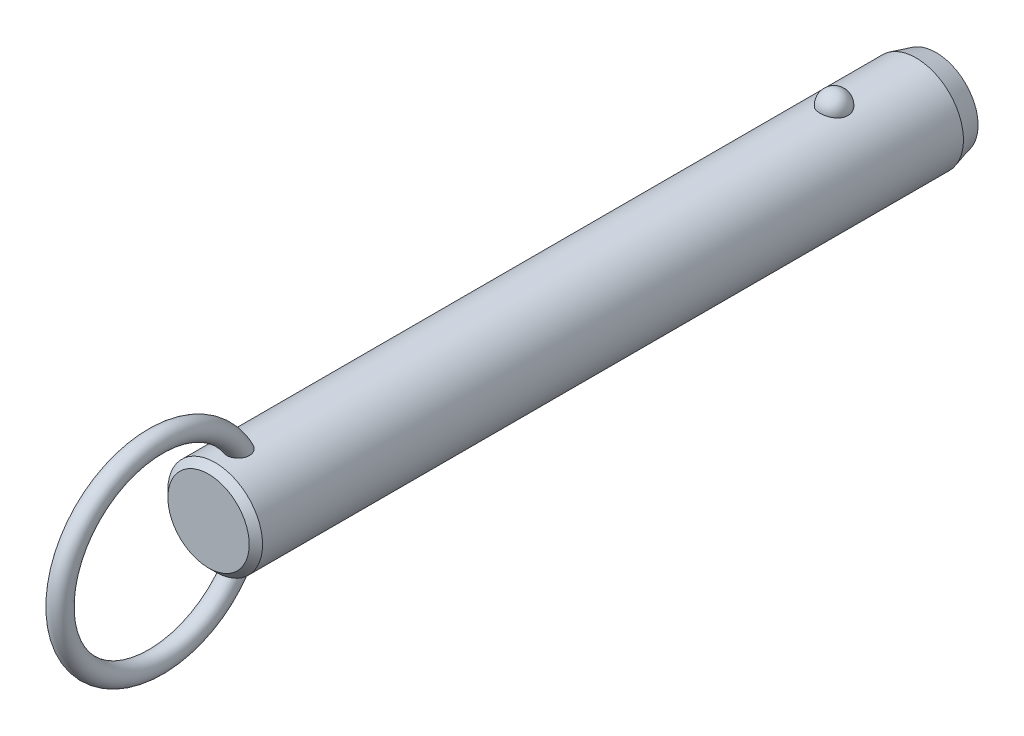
ISO-10303-21;
HEADER;
FILE_DESCRIPTION(('STEP AP214'),'2;1');
FILE_NAME('part.step','',(''),(''),'','','');
FILE_SCHEMA(('AUTOMOTIVE_DESIGN { 1 0 10303 214 1 1 1 1 }'));
ENDSEC;
DATA;
#1=APPLICATION_CONTEXT('core data for automotive mechanical design processes');
#2=APPLICATION_PROTOCOL_DEFINITION('international standard','automotive_design',2000,#1);
#3=PRODUCT_CONTEXT('',#1,'mechanical');
#4=PRODUCT('Part','Part','',(#3));
#5=PRODUCT_RELATED_PRODUCT_CATEGORY('part','',(#4));
#6=PRODUCT_DEFINITION_FORMATION('','',#4);
#7=PRODUCT_DEFINITION_CONTEXT('part definition',#1,'design');
#8=PRODUCT_DEFINITION('design','',#6,#7);
#9=PRODUCT_DEFINITION_SHAPE('','',#8);
#10=(LENGTH_UNIT() NAMED_UNIT(*) SI_UNIT(.MILLI.,.METRE.));
#11=(NAMED_UNIT(*) PLANE_ANGLE_UNIT() SI_UNIT($,.RADIAN.));
#12=(NAMED_UNIT(*) SI_UNIT($,.STERADIAN.) SOLID_ANGLE_UNIT());
#13=UNCERTAINTY_MEASURE_WITH_UNIT(LENGTH_MEASURE(1.E-05),#10,'distance_accuracy_value','');
#14=(GEOMETRIC_REPRESENTATION_CONTEXT(3) GLOBAL_UNCERTAINTY_ASSIGNED_CONTEXT((#13)) GLOBAL_UNIT_ASSIGNED_CONTEXT((#10,
#11,#12)) REPRESENTATION_CONTEXT('',''));
#15=CARTESIAN_POINT('',(0.,0.,0.));
#16=DIRECTION('',(0.,0.,1.));
#17=DIRECTION('',(1.,0.,0.));
#18=AXIS2_PLACEMENT_3D('',#15,#16,#17);
#19=CARTESIAN_POINT('',(0.,0.,83.8));
#20=DIRECTION('',(0.,0.,-1.));
#21=DIRECTION('',(-1.,0.,0.));
#22=AXIS2_PLACEMENT_3D('',#19,#20,#21);
#23=CYLINDRICAL_SURFACE('',#22,7.1);
#24=CARTESIAN_POINT('',(2.0769088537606,6.78943661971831,-2.1));
#25=CARTESIAN_POINT('',(2.07690739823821,6.78943796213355,-1.98268154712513));
#26=CARTESIAN_POINT('',(2.06738130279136,6.79237331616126,-1.86534506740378));
#27=CARTESIAN_POINT('',(2.0295040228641,6.8037853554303,-1.63400788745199));
#28=CARTESIAN_POINT('',(2.00114757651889,6.81226358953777,-1.52000812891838));
#29=CARTESIAN_POINT('',(1.92632025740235,6.83379798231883,-1.29863433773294));
#30=CARTESIAN_POINT('',(1.87985726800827,6.84685214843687,-1.19125744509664));
#31=CARTESIAN_POINT('',(1.76995205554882,6.87608091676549,-0.98604657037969));
#32=CARTESIAN_POINT('',(1.70650980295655,6.8922555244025,-0.88821260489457));
#33=CARTESIAN_POINT('',(1.5638119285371,6.92602930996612,-0.704242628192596));
#34=CARTESIAN_POINT('',(1.4844714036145,6.94363582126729,-0.618173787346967));
#35=CARTESIAN_POINT('',(1.31221746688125,6.97823658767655,-0.460740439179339));
#36=CARTESIAN_POINT('',(1.21930409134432,6.99523084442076,-0.389375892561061));
#37=CARTESIAN_POINT('',(1.02268781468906,7.02666176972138,-0.263547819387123));
#38=CARTESIAN_POINT('',(0.91902009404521,7.04110638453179,-0.209031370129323));
#39=CARTESIAN_POINT('',(0.703548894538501,7.06588726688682,-0.118163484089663));
#40=CARTESIAN_POINT('',(0.591746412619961,7.07622403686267,-0.0818098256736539));
#41=CARTESIAN_POINT('',(0.365557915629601,7.09147068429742,-0.0288711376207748));
#42=CARTESIAN_POINT('',(0.251267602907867,7.09648447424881,-0.0119070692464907));
#43=CARTESIAN_POINT('',(0.0213499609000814,7.10089837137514,0.00304925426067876));
#44=CARTESIAN_POINT('',(-0.0942772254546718,7.10029907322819,0.00104351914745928));
#45=CARTESIAN_POINT('',(-0.321651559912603,7.09360829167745,-0.0216931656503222));
#46=CARTESIAN_POINT('',(-0.433431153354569,7.08760388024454,-0.0421272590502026));
#47=CARTESIAN_POINT('',(-0.651862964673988,7.07086131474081,-0.100729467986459));
#48=CARTESIAN_POINT('',(-0.758515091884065,7.06012307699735,-0.138897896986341));
#49=CARTESIAN_POINT('',(-0.964449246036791,7.03496097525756,-0.232213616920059));
#50=CARTESIAN_POINT('',(-1.06368095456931,7.02051445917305,-0.287465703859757));
#51=CARTESIAN_POINT('',(-1.25145353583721,6.98948740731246,-0.413383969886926));
#52=CARTESIAN_POINT('',(-1.33999321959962,6.97290663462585,-0.48405186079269));
#53=CARTESIAN_POINT('',(-1.50591604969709,6.93898770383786,-0.640594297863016));
#54=CARTESIAN_POINT('',(-1.58302488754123,6.92164094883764,-0.726757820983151));
#55=CARTESIAN_POINT('',(-1.72189320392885,6.8884103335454,-0.91092752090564));
#56=CARTESIAN_POINT('',(-1.78365144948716,6.87252659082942,-1.008934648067));
#57=CARTESIAN_POINT('',(-1.89101272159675,6.84377189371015,-1.21549497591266));
#58=CARTESIAN_POINT('',(-1.93639553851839,6.83094274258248,-1.32416860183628));
#59=CARTESIAN_POINT('',(-2.00874275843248,6.81002070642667,-1.54791500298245));
#60=CARTESIAN_POINT('',(-2.03570774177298,6.80192767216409,-1.66298757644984));
#61=CARTESIAN_POINT('',(-2.07047276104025,6.7914266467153,-1.89571453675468));
#62=CARTESIAN_POINT('',(-2.07835878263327,6.78899315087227,-2.01335491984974));
#63=CARTESIAN_POINT('',(-2.07502083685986,6.79001409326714,-2.24833570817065));
#64=CARTESIAN_POINT('',(-2.06379746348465,6.7934683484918,-2.36567612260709));
#65=CARTESIAN_POINT('',(-2.02263913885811,6.80583442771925,-2.59603194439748));
#66=CARTESIAN_POINT('',(-1.99281127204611,6.81471501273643,-2.70906820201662));
#67=CARTESIAN_POINT('',(-1.91526639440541,6.83691232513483,-2.92836575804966));
#68=CARTESIAN_POINT('',(-1.8675486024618,6.85022924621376,-3.03462676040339));
#69=CARTESIAN_POINT('',(-1.75504492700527,6.87991336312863,-3.23806487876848));
#70=CARTESIAN_POINT('',(-1.69015924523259,6.89629822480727,-3.33518422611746));
#71=CARTESIAN_POINT('',(-1.54505404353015,6.93024852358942,-3.51697105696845));
#72=CARTESIAN_POINT('',(-1.46483385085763,6.94781401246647,-3.60163799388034));
#73=CARTESIAN_POINT('',(-1.29071406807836,6.98225977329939,-3.75654119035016));
#74=CARTESIAN_POINT('',(-1.19675650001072,6.99913673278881,-3.82671308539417));
#75=CARTESIAN_POINT('',(-0.997940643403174,7.03023618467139,-3.9501837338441));
#76=CARTESIAN_POINT('',(-0.89308318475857,7.04445887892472,-4.00348377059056));
#77=CARTESIAN_POINT('',(-0.676902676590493,7.06848365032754,-4.09107242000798));
#78=CARTESIAN_POINT('',(-0.565686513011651,7.0783430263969,-4.12560889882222));
#79=CARTESIAN_POINT('',(-0.338739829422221,7.09282534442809,-4.17575450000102));
#80=CARTESIAN_POINT('',(-0.223009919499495,7.09744899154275,-4.19136617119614));
#81=CARTESIAN_POINT('',(0.00707628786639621,7.10090930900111,-4.20307965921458));
#82=CARTESIAN_POINT('',(0.121410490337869,7.09986531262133,-4.19958377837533));
#83=CARTESIAN_POINT('',(0.347815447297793,7.092380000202,-4.17411564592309));
#84=CARTESIAN_POINT('',(0.459886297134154,7.08593891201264,-4.15214417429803));
#85=CARTESIAN_POINT('',(0.678084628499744,7.06838983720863,-4.09049562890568));
#86=CARTESIAN_POINT('',(0.784237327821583,7.05730369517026,-4.05090137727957));
#87=CARTESIAN_POINT('',(0.988305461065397,7.03163139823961,-3.95511447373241));
#88=CARTESIAN_POINT('',(1.08622031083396,7.01704499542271,-3.89892064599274));
#89=CARTESIAN_POINT('',(1.27284490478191,6.98562668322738,-3.77035541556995));
#90=CARTESIAN_POINT('',(1.36137372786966,6.96876135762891,-3.69772964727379));
#91=CARTESIAN_POINT('',(1.52509486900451,6.93477412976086,-3.53878279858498));
#92=CARTESIAN_POINT('',(1.60028496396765,6.91765218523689,-3.45245943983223));
#93=CARTESIAN_POINT('',(1.73681688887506,6.88465753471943,-3.26658774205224));
#94=CARTESIAN_POINT('',(1.79785966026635,6.86881574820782,-3.16681408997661));
#95=CARTESIAN_POINT('',(1.90265327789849,6.84053157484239,-2.95814408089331));
#96=CARTESIAN_POINT('',(1.94640861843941,6.82808830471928,-2.84925010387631));
#97=CARTESIAN_POINT('',(2.01274378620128,6.80881460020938,-2.63454318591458));
#98=CARTESIAN_POINT('',(2.03676193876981,6.80160856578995,-2.52920574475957));
#99=CARTESIAN_POINT('',(2.06884490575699,6.79191902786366,-2.3159172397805));
#100=CARTESIAN_POINT('',(2.07691019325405,6.78943538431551,-2.20796625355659));
#101=CARTESIAN_POINT('',(2.0769088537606,6.78943661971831,-2.1));
#102=B_SPLINE_CURVE_WITH_KNOTS('',3,(#24,#25,#26,#27,#28,#29,#30,#31,#32,#33,#34,#35,#36,#37,
#38,#39,#40,#41,#42,#43,#44,#45,#46,#47,#48,#49,#50,#51,#52,#53,#54,#55,#56,#57,#58,#59,#60,#61,
#62,#63,#64,#65,#66,#67,#68,#69,#70,#71,#72,#73,#74,#75,#76,#77,#78,#79,#80,#81,#82,#83,#84,#85,
#86,#87,#88,#89,#90,#91,#92,#93,#94,#95,#96,#97,#98,#99,#100,#101),.UNSPECIFIED.,.T.,.F.,(4,2,2,
2,2,2,2,2,2,2,2,2,2,2,2,2,2,2,2,2,2,2,2,2,2,2,2,2,2,2,2,2,2,2,2,2,2,2,4),(0.,0.351568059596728,
0.703234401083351,1.05474780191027,1.40626181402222,1.75970563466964,2.11314851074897,
2.4654696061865,2.81774759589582,3.16301449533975,3.50824481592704,3.84801136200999,
4.18778391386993,4.52968352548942,4.87162112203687,5.22076181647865,5.56993054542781,
5.92363364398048,6.27732559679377,6.62942052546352,6.98150450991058,7.33158042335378,
7.68167162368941,8.03384443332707,8.38603269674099,8.73975272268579,9.09344583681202,
9.44234545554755,9.79119807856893,10.1327344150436,10.4742563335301,10.8141898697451,
11.1541474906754,11.4997793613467,11.8454687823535,12.1979079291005,12.5502553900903,
12.8738073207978,13.1973496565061),.UNSPECIFIED.);
#103=CARTESIAN_POINT('',(2.0769088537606,6.78943661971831,-2.1));
#104=VERTEX_POINT('',#103);
#105=EDGE_CURVE('E41',#104,#104,#102,.T.);
#106=ORIENTED_EDGE('',*,*,#105,.T.);
#107=EDGE_LOOP('',(#106));
#108=FACE_BOUND('',#107,.T.);
#109=CARTESIAN_POINT('',(0.,0.,90.72));
#110=DIRECTION('',(0.,0.,1.));
#111=DIRECTION('',(1.,0.,0.));
#112=AXIS2_PLACEMENT_3D('',#109,#110,#111);
#113=CIRCLE('',#112,7.1);
#114=CARTESIAN_POINT('',(7.1,0.,90.72));
#115=VERTEX_POINT('',#114);
#116=EDGE_CURVE('E10',#115,#115,#113,.F.);
#117=ORIENTED_EDGE('',*,*,#116,.T.);
#118=EDGE_LOOP('',(#117));
#119=FACE_BOUND('',#118,.T.);
#120=CARTESIAN_POINT('',(-0.429539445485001,-7.08699541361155,85.5429212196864));
#121=CARTESIAN_POINT('',(-0.508331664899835,-7.08221999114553,85.5668764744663));
#122=CARTESIAN_POINT('',(-0.585039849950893,-7.07624016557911,85.5974570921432));
#123=CARTESIAN_POINT('',(-0.732082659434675,-7.06254296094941,85.6710242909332));
#124=CARTESIAN_POINT('',(-0.802417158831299,-7.05482554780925,85.7140111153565));
#125=CARTESIAN_POINT('',(-0.934722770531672,-7.03851844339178,85.8111135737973));
#126=CARTESIAN_POINT('',(-0.996700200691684,-7.02992941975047,85.8652207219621));
#127=CARTESIAN_POINT('',(-1.11079942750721,-7.01280697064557,85.9829676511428));
#128=CARTESIAN_POINT('',(-1.16292136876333,-7.00427354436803,86.0466072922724));
#129=CARTESIAN_POINT('',(-1.25705660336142,-6.98799959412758,86.1826870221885));
#130=CARTESIAN_POINT('',(-1.29888032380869,-6.98027525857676,86.2552598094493));
#131=CARTESIAN_POINT('',(-1.37069920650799,-6.96652886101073,86.4061686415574));
#132=CARTESIAN_POINT('',(-1.40069157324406,-6.96050720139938,86.4845060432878));
#133=CARTESIAN_POINT('',(-1.45043507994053,-6.95031881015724,86.6501903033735));
#134=CARTESIAN_POINT('',(-1.46937115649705,-6.94630231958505,86.7377897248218));
#135=CARTESIAN_POINT('',(-1.49424917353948,-6.94099239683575,86.9148714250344));
#136=CARTESIAN_POINT('',(-1.50018601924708,-6.93970003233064,87.0043544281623));
#137=CARTESIAN_POINT('',(-1.49978214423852,-6.93978815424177,87.1940607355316));
#138=CARTESIAN_POINT('',(-1.49187639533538,-6.94150934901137,87.294279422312));
#139=CARTESIAN_POINT('',(-1.46177925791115,-6.94790814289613,87.4924798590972));
#140=CARTESIAN_POINT('',(-1.43957541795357,-6.95258831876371,87.590459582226));
#141=CARTESIAN_POINT('',(-1.37783293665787,-6.96510647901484,87.7953629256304));
#142=CARTESIAN_POINT('',(-1.33634073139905,-6.97328848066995,87.9016801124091));
#143=CARTESIAN_POINT('',(-1.23686994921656,-6.99161706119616,88.1061777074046));
#144=CARTESIAN_POINT('',(-1.17889192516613,-7.00176357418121,88.2043583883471));
#145=CARTESIAN_POINT('',(-1.0587512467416,-7.02082898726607,88.372374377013));
#146=CARTESIAN_POINT('',(-0.999247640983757,-7.02963746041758,88.4441230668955));
#147=CARTESIAN_POINT('',(-0.869494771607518,-7.04686074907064,88.5771959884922));
#148=CARTESIAN_POINT('',(-0.79926347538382,-7.05527619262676,88.6385372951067));
#149=CARTESIAN_POINT('',(-0.665408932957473,-7.06899457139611,88.7351316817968));
#150=CARTESIAN_POINT('',(-0.603817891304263,-7.07457275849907,88.7731512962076));
#151=CARTESIAN_POINT('',(-0.475172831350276,-7.08437420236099,88.8387581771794));
#152=CARTESIAN_POINT('',(-0.408123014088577,-7.08859848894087,88.8663533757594));
#153=CARTESIAN_POINT('',(-0.269431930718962,-7.09522749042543,88.9092569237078));
#154=CARTESIAN_POINT('',(-0.197757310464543,-7.09761688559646,88.9244618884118));
#155=CARTESIAN_POINT('',(-0.0527849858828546,-7.10017268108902,88.9407168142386));
#156=CARTESIAN_POINT('',(0.0205115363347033,-7.10034065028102,88.9417767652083));
#157=CARTESIAN_POINT('',(0.156426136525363,-7.09855986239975,88.9304619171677));
#158=CARTESIAN_POINT('',(0.219199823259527,-7.09688191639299,88.9198060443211));
#159=CARTESIAN_POINT('',(0.342134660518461,-7.09201880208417,88.8885379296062));
#160=CARTESIAN_POINT('',(0.402295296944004,-7.08883333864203,88.8679237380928));
#161=CARTESIAN_POINT('',(0.520687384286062,-7.08113868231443,88.8172125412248));
#162=CARTESIAN_POINT('',(0.57879126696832,-7.07658958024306,88.7868272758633));
#163=CARTESIAN_POINT('',(0.690173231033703,-7.06659708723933,88.7183678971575));
#164=CARTESIAN_POINT('',(0.743447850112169,-7.061153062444,88.6802883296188));
#165=CARTESIAN_POINT('',(0.870947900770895,-7.04680292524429,88.5765929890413));
#166=CARTESIAN_POINT('',(0.941828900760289,-7.0375580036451,88.5068972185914));
#167=CARTESIAN_POINT('',(1.07136606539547,-7.01900793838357,88.3569450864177));
#168=CARTESIAN_POINT('',(1.13000013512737,-7.00970271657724,88.2766700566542));
#169=CARTESIAN_POINT('',(1.23579584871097,-6.99183327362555,88.1068997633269));
#170=CARTESIAN_POINT('',(1.28274271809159,-6.98328455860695,88.0172696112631));
#171=CARTESIAN_POINT('',(1.36351442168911,-6.96796352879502,87.8321763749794));
#172=CARTESIAN_POINT('',(1.39733971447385,-6.96119115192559,87.7367134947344));
#173=CARTESIAN_POINT('',(1.45579181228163,-6.94922464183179,87.5253092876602));
#174=CARTESIAN_POINT('',(1.47790145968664,-6.94449000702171,87.408631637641));
#175=CARTESIAN_POINT('',(1.50168752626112,-6.93938731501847,87.1730153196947));
#176=CARTESIAN_POINT('',(1.50336085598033,-6.93901991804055,87.0540763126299));
#177=CARTESIAN_POINT('',(1.48486516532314,-6.9430010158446,86.8236079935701));
#178=CARTESIAN_POINT('',(1.46573441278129,-6.9471253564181,86.7119958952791));
#179=CARTESIAN_POINT('',(1.40606892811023,-6.95944667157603,86.4948868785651));
#180=CARTESIAN_POINT('',(1.3655644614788,-6.96763788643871,86.3893815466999));
#181=CARTESIAN_POINT('',(1.27082700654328,-6.98548038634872,86.2042879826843));
#182=CARTESIAN_POINT('',(1.21949810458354,-6.99473841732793,86.1231719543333));
#183=CARTESIAN_POINT('',(1.10242050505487,-7.01414069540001,85.9722278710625));
#184=CARTESIAN_POINT('',(1.03668119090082,-7.02428436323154,85.9023925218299));
#185=CARTESIAN_POINT('',(0.900559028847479,-7.04295285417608,85.7835735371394));
#186=CARTESIAN_POINT('',(0.831428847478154,-7.05153466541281,85.7331573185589));
#187=CARTESIAN_POINT('',(0.685291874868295,-7.06723150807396,85.6451429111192));
#188=CARTESIAN_POINT('',(0.608287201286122,-7.0743469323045,85.6075412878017));
#189=CARTESIAN_POINT('',(0.451878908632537,-7.08602232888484,85.5474915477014));
#190=CARTESIAN_POINT('',(0.372686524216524,-7.09067127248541,85.5245088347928));
#191=CARTESIAN_POINT('',(0.211477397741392,-7.09730788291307,85.4920357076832));
#192=CARTESIAN_POINT('',(0.129460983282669,-7.09929585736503,85.4825437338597));
#193=CARTESIAN_POINT('',(-0.0332905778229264,-7.10037858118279,85.4773517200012));
#194=CARTESIAN_POINT('',(-0.114016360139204,-7.09953334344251,85.4813656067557));
#195=CARTESIAN_POINT('',(-0.273670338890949,-7.09517338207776,85.5024540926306));
#196=CARTESIAN_POINT('',(-0.352598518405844,-7.09165863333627,85.5195288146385));
#197=CARTESIAN_POINT('',(-0.429539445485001,-7.08699541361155,85.5429212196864));
#198=B_SPLINE_CURVE_WITH_KNOTS('',3,(#120,#121,#122,#123,#124,#125,#126,#127,#128,#129,#130,
#131,#132,#133,#134,#135,#136,#137,#138,#139,#140,#141,#142,#143,#144,#145,#146,#147,#148,#149,
#150,#151,#152,#153,#154,#155,#156,#157,#158,#159,#160,#161,#162,#163,#164,#165,#166,#167,#168,
#169,#170,#171,#172,#173,#174,#175,#176,#177,#178,#179,#180,#181,#182,#183,#184,#185,#186,#187,
#188,#189,#190,#191,#192,#193,#194,#195,#196,#197),.UNSPECIFIED.,.T.,.F.,(4,2,2,2,2,2,2,2,2,2,2,
2,2,2,2,2,2,2,2,2,2,2,2,2,2,2,2,2,2,2,2,2,2,2,2,2,2,2,4),(0.,0.247183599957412,0.49437204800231,
0.741372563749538,0.988369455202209,1.23962059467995,1.49093106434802,1.75897818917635,
2.02713035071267,2.32758265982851,2.62829697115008,2.97008736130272,3.31186629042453,
3.59175319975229,3.87117637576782,4.08813841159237,4.30493502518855,4.52352259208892,
4.74195577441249,4.93215328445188,5.12238804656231,5.31884850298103,5.51544871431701,
5.81332317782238,6.11173048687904,6.41527266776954,6.71880423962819,7.07358156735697,
7.42841252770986,7.76631485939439,8.10373999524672,8.39142246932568,8.67891817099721,
8.93560332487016,9.19221962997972,9.43881106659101,9.68537399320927,9.92674752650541,
10.1681233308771),.UNSPECIFIED.);
#199=CARTESIAN_POINT('',(-0.429539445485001,-7.08699541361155,85.5429212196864));
#200=VERTEX_POINT('',#199);
#201=EDGE_CURVE('E59',#200,#200,#198,.T.);
#202=ORIENTED_EDGE('',*,*,#201,.T.);
#203=EDGE_LOOP('',(#202));
#204=FACE_BOUND('',#203,.T.);
#205=CARTESIAN_POINT('',(-0.429539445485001,7.08699541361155,85.5429212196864));
#206=CARTESIAN_POINT('',(-0.351665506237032,7.09171429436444,85.5192469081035));
#207=CARTESIAN_POINT('',(-0.271733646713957,7.09525896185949,85.5020369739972));
#208=CARTESIAN_POINT('',(-0.110026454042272,7.09960839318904,85.4810059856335));
#209=CARTESIAN_POINT('',(-0.0282502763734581,7.10041187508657,85.477191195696));
#210=CARTESIAN_POINT('',(0.134782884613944,7.09918849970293,85.483059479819));
#211=CARTESIAN_POINT('',(0.216039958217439,7.09716214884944,85.4927401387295));
#212=CARTESIAN_POINT('',(0.375730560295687,7.09050177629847,85.5253471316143));
#213=CARTESIAN_POINT('',(0.454164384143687,7.08586802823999,85.5482720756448));
#214=CARTESIAN_POINT('',(0.60602533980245,7.07449911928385,85.606771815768));
#215=CARTESIAN_POINT('',(0.679451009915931,7.06776334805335,85.6423502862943));
#216=CARTESIAN_POINT('',(0.819234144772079,7.05292866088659,85.7251753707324));
#217=CARTESIAN_POINT('',(0.88559181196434,7.04482978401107,85.7724216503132));
#218=CARTESIAN_POINT('',(1.00993211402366,7.02808709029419,85.8775902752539));
#219=CARTESIAN_POINT('',(1.06785399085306,7.01943990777,85.935583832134));
#220=CARTESIAN_POINT('',(1.17342527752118,7.00256662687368,86.0603013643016));
#221=CARTESIAN_POINT('',(1.22107408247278,6.99434055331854,86.1270258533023));
#222=CARTESIAN_POINT('',(1.30652927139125,6.97889183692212,86.2693622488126));
#223=CARTESIAN_POINT('',(1.34399711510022,6.97170674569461,86.3451808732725));
#224=CARTESIAN_POINT('',(1.40682616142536,6.95930080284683,86.5018100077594));
#225=CARTESIAN_POINT('',(1.43218374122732,6.95408053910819,86.5826220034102));
#226=CARTESIAN_POINT('',(1.47246409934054,6.94566853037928,86.7535314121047));
#227=CARTESIAN_POINT('',(1.48642590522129,6.9426653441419,86.8438630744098));
#228=CARTESIAN_POINT('',(1.5011410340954,6.93949744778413,87.025619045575));
#229=CARTESIAN_POINT('',(1.50188917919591,6.93933385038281,87.1170437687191));
#230=CARTESIAN_POINT('',(1.49030464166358,6.94183245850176,87.3108438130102));
#231=CARTESIAN_POINT('',(1.47627413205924,6.94486147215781,87.413112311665));
#232=CARTESIAN_POINT('',(1.43356351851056,6.95380194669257,87.6144719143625));
#233=CARTESIAN_POINT('',(1.4048676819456,6.95971650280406,87.7135594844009));
#234=CARTESIAN_POINT('',(1.32908750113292,6.97461208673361,87.9189087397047));
#235=CARTESIAN_POINT('',(1.28011435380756,6.98388945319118,88.0244566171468));
#236=CARTESIAN_POINT('',(1.16520357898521,7.00397743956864,88.2257604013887));
#237=CARTESIAN_POINT('',(1.09927694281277,7.01478706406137,88.3215225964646));
#238=CARTESIAN_POINT('',(0.969361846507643,7.03373936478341,88.4767565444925));
#239=CARTESIAN_POINT('',(0.909042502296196,7.04187023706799,88.5393032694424));
#240=CARTESIAN_POINT('',(0.779178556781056,7.05741732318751,88.6540535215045));
#241=CARTESIAN_POINT('',(0.709649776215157,7.06483472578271,88.7062744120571));
#242=CARTESIAN_POINT('',(0.576854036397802,7.0767751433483,88.7881138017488));
#243=CARTESIAN_POINT('',(0.515118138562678,7.08158033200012,88.8201641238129));
#244=CARTESIAN_POINT('',(0.387127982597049,7.08972701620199,88.8737656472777));
#245=CARTESIAN_POINT('',(0.320877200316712,7.09306962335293,88.8953248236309));
#246=CARTESIAN_POINT('',(0.185041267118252,7.09791507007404,88.9264005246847));
#247=CARTESIAN_POINT('',(0.115437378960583,7.09940591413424,88.9358385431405));
#248=CARTESIAN_POINT('',(-0.0243157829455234,7.10030171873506,88.9415226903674));
#249=CARTESIAN_POINT('',(-0.0944648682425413,7.0997073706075,88.9377731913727));
#250=CARTESIAN_POINT('',(-0.225713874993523,7.09668414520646,88.9185081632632));
#251=CARTESIAN_POINT('',(-0.287006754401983,7.09444865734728,88.9042323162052));
#252=CARTESIAN_POINT('',(-0.40655537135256,7.08860360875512,88.8663685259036));
#253=CARTESIAN_POINT('',(-0.464809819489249,7.08499346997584,88.8427766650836));
#254=CARTESIAN_POINT('',(-0.594955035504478,7.07541654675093,88.7789232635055));
#255=CARTESIAN_POINT('',(-0.665389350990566,7.06906574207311,88.735753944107));
#256=CARTESIAN_POINT('',(-0.798242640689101,7.05530261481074,88.638587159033));
#257=CARTESIAN_POINT('',(-0.860645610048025,7.0478882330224,88.5845686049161));
#258=CARTESIAN_POINT('',(-0.994249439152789,7.03045217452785,88.4509965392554));
#259=CARTESIAN_POINT('',(-1.06260129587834,7.02030745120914,88.3686143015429));
#260=CARTESIAN_POINT('',(-1.18502045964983,7.00068382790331,88.193843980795));
#261=CARTESIAN_POINT('',(-1.23907684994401,6.99120544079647,88.101448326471));
#262=CARTESIAN_POINT('',(-1.33335589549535,6.97384343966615,87.9080085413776));
#263=CARTESIAN_POINT('',(-1.3733613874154,6.96598557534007,87.8068564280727));
#264=CARTESIAN_POINT('',(-1.43770677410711,6.9529905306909,87.5995046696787));
#265=CARTESIAN_POINT('',(-1.46204473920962,6.94785368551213,87.49330440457));
#266=CARTESIAN_POINT('',(-1.49537533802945,6.94076296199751,87.2682317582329));
#267=CARTESIAN_POINT('',(-1.50273564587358,6.93914842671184,87.1490975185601));
#268=CARTESIAN_POINT('',(-1.4954555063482,6.94072368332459,86.9114703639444));
#269=CARTESIAN_POINT('',(-1.48082914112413,6.94391040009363,86.7929770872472));
#270=CARTESIAN_POINT('',(-1.43076401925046,6.95438579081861,86.5734325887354));
#271=CARTESIAN_POINT('',(-1.39762227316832,6.96121852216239,86.4718413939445));
#272=CARTESIAN_POINT('',(-1.31211274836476,6.97783941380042,86.2773513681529));
#273=CARTESIAN_POINT('',(-1.2597660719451,6.98762432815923,86.1844431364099));
#274=CARTESIAN_POINT('',(-1.14583073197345,7.00713153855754,86.0241601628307));
#275=CARTESIAN_POINT('',(-1.08665947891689,7.01665982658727,85.9550351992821));
#276=CARTESIAN_POINT('',(-0.956606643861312,7.03556646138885,85.8288786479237));
#277=CARTESIAN_POINT('',(-0.885737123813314,7.04494495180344,85.7718347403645));
#278=CARTESIAN_POINT('',(-0.751558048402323,7.06035735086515,85.6831004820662));
#279=CARTESIAN_POINT('',(-0.690120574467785,7.0666695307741,85.6485932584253));
#280=CARTESIAN_POINT('',(-0.562815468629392,7.07794609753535,85.5887507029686));
#281=CARTESIAN_POINT('',(-0.496948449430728,7.08291067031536,85.5634141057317));
#282=CARTESIAN_POINT('',(-0.429539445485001,7.08699541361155,85.5429212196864));
#283=B_SPLINE_CURVE_WITH_KNOTS('',3,(#205,#206,#207,#208,#209,#210,#211,#212,#213,#214,#215,
#216,#217,#218,#219,#220,#221,#222,#223,#224,#225,#226,#227,#228,#229,#230,#231,#232,#233,#234,
#235,#236,#237,#238,#239,#240,#241,#242,#243,#244,#245,#246,#247,#248,#249,#250,#251,#252,#253,
#254,#255,#256,#257,#258,#259,#260,#261,#262,#263,#264,#265,#266,#267,#268,#269,#270,#271,#272,
#273,#274,#275,#276,#277,#278,#279,#280,#281,#282),.UNSPECIFIED.,.T.,.F.,(4,2,2,2,2,2,2,2,2,2,2,
2,2,2,2,2,2,2,2,2,2,2,2,2,2,2,2,2,2,2,2,2,2,2,2,2,2,2,4),(0.,0.244335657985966,
0.488785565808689,0.733191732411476,0.977572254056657,1.22202379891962,1.46646834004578,
1.71259457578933,1.95873529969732,2.21226768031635,2.46587585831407,2.73913816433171,
3.01250754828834,3.32109936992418,3.63002293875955,3.9786351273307,4.32702187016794,
4.58793945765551,4.84841449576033,5.05676704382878,5.26496096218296,5.47449661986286,
5.68396281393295,5.87205447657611,6.06022532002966,6.30743751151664,6.55513496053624,
6.87602468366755,7.19715875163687,7.52305774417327,7.84899686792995,8.20516155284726,
8.56109821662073,8.88040084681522,9.19935367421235,9.47236282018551,9.74509220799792,
9.9566225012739,10.1681235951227),.UNSPECIFIED.);
#284=CARTESIAN_POINT('',(-0.429539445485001,7.08699541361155,85.5429212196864));
#285=VERTEX_POINT('',#284);
#286=EDGE_CURVE('E67',#285,#285,#283,.T.);
#287=ORIENTED_EDGE('',*,*,#286,.T.);
#288=EDGE_LOOP('',(#287));
#289=FACE_BOUND('',#288,.T.);
#290=CARTESIAN_POINT('',(0.,0.,-14.4));
#291=DIRECTION('',(0.,0.,-1.));
#292=DIRECTION('',(-1.,0.,0.));
#293=AXIS2_PLACEMENT_3D('',#290,#291,#292);
#294=CIRCLE('',#293,7.1);
#295=CARTESIAN_POINT('',(-7.1,0.,-14.4));
#296=VERTEX_POINT('',#295);
#297=EDGE_CURVE('E56',#296,#296,#294,.F.);
#298=ORIENTED_EDGE('',*,*,#297,.T.);
#299=EDGE_LOOP('',(#298));
#300=FACE_BOUND('',#299,.T.);
#301=ADVANCED_FACE('F37',(#108,#119,#204,#289,#300),#23,.T.);
#302=CARTESIAN_POINT('',(0.,0.,-17.4));
#303=DIRECTION('',(0.,0.,-1.));
#304=DIRECTION('',(-1.,0.,0.));
#305=AXIS2_PLACEMENT_3D('',#302,#303,#304);
#306=PLANE('',#305);
#307=CARTESIAN_POINT('',(0.,0.,-17.4));
#308=DIRECTION('',(0.,0.,-1.));
#309=DIRECTION('',(-1.,0.,0.));
#310=AXIS2_PLACEMENT_3D('',#307,#308,#309);
#311=CIRCLE('',#310,6.29615242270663);
#312=CARTESIAN_POINT('',(-6.29615242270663,0.,-17.4));
#313=VERTEX_POINT('',#312);
#314=EDGE_CURVE('E66',#313,#313,#311,.T.);
#315=ORIENTED_EDGE('',*,*,#314,.T.);
#316=EDGE_LOOP('',(#315));
#317=FACE_BOUND('',#316,.T.);
#318=ADVANCED_FACE('F85',(#317),#306,.T.);
#319=CARTESIAN_POINT('',(0.,0.,-17.4));
#320=DIRECTION('',(0.,0.,1.));
#321=DIRECTION('',(1.,0.,0.));
#322=AXIS2_PLACEMENT_3D('',#319,#320,#321);
#323=CONICAL_SURFACE('',#322,6.29615242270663,0.261799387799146);
#324=ORIENTED_EDGE('',*,*,#297,.F.);
#325=EDGE_LOOP('',(#324));
#326=FACE_BOUND('',#325,.T.);
#327=ORIENTED_EDGE('',*,*,#314,.F.);
#328=EDGE_LOOP('',(#327));
#329=FACE_BOUND('',#328,.T.);
#330=ADVANCED_FACE('F83',(#326,#329),#323,.T.);
#331=CARTESIAN_POINT('',(0.,0.,91.72));
#332=DIRECTION('',(0.,0.,1.));
#333=DIRECTION('',(1.,0.,0.));
#334=AXIS2_PLACEMENT_3D('',#331,#332,#333);
#335=PLANE('',#334);
#336=CARTESIAN_POINT('',(0.,0.,91.72));
#337=DIRECTION('',(0.,0.,1.));
#338=DIRECTION('',(1.,0.,0.));
#339=AXIS2_PLACEMENT_3D('',#336,#337,#338);
#340=CIRCLE('',#339,6.10000000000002);
#341=CARTESIAN_POINT('',(6.10000000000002,0.,91.72));
#342=VERTEX_POINT('',#341);
#343=EDGE_CURVE('E50',#342,#342,#340,.T.);
#344=ORIENTED_EDGE('',*,*,#343,.T.);
#345=EDGE_LOOP('',(#344));
#346=FACE_BOUND('',#345,.T.);
#347=ADVANCED_FACE('F77',(#346),#335,.T.);
#348=CARTESIAN_POINT('',(0.,0.,99.65));
#349=DIRECTION('',(1.,0.,0.));
#350=DIRECTION('',(0.,0.,-1.));
#351=AXIS2_PLACEMENT_3D('',#348,#349,#350);
#352=TOROIDAL_SURFACE('',#351,14.35,1.5);
#353=ORIENTED_EDGE('',*,*,#286,.F.);
#354=EDGE_LOOP('',(#353));
#355=FACE_BOUND('',#354,.T.);
#356=ORIENTED_EDGE('',*,*,#201,.F.);
#357=EDGE_LOOP('',(#356));
#358=FACE_BOUND('',#357,.T.);
#359=ADVANCED_FACE('F73',(#355,#358),#352,.T.);
#360=CARTESIAN_POINT('',(0.,0.,91.72));
#361=DIRECTION('',(0.,0.,-1.));
#362=DIRECTION('',(-1.,0.,0.));
#363=AXIS2_PLACEMENT_3D('',#360,#361,#362);
#364=CONICAL_SURFACE('',#363,6.10000000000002,0.785398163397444);
#365=ORIENTED_EDGE('',*,*,#116,.F.);
#366=EDGE_LOOP('',(#365));
#367=FACE_BOUND('',#366,.T.);
#368=ORIENTED_EDGE('',*,*,#343,.F.);
#369=EDGE_LOOP('',(#368));
#370=FACE_BOUND('',#369,.T.);
#371=ADVANCED_FACE('F39',(#367,#370),#364,.T.);
#372=CARTESIAN_POINT('',(0.,7.1,-2.1));
#373=DIRECTION('',(0.,1.,0.));
#374=DIRECTION('',(0.,0.,1.));
#375=AXIS2_PLACEMENT_3D('',#372,#373,#374);
#376=SPHERICAL_SURFACE('',#375,2.10000000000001);
#377=ORIENTED_EDGE('',*,*,#105,.F.);
#378=EDGE_LOOP('',(#377));
#379=FACE_BOUND('',#378,.T.);
#380=ADVANCED_FACE('F79',(#379),#376,.T.);
#381=CLOSED_SHELL('',(#301,#318,#330,#347,#359,#371,#380));
#382=MANIFOLD_SOLID_BREP('B2',#381);
#383=ADVANCED_BREP_SHAPE_REPRESENTATION('',(#18,#382),#14);
#384=SHAPE_DEFINITION_REPRESENTATION(#9,#383);
ENDSEC;
END-ISO-10303-21;
